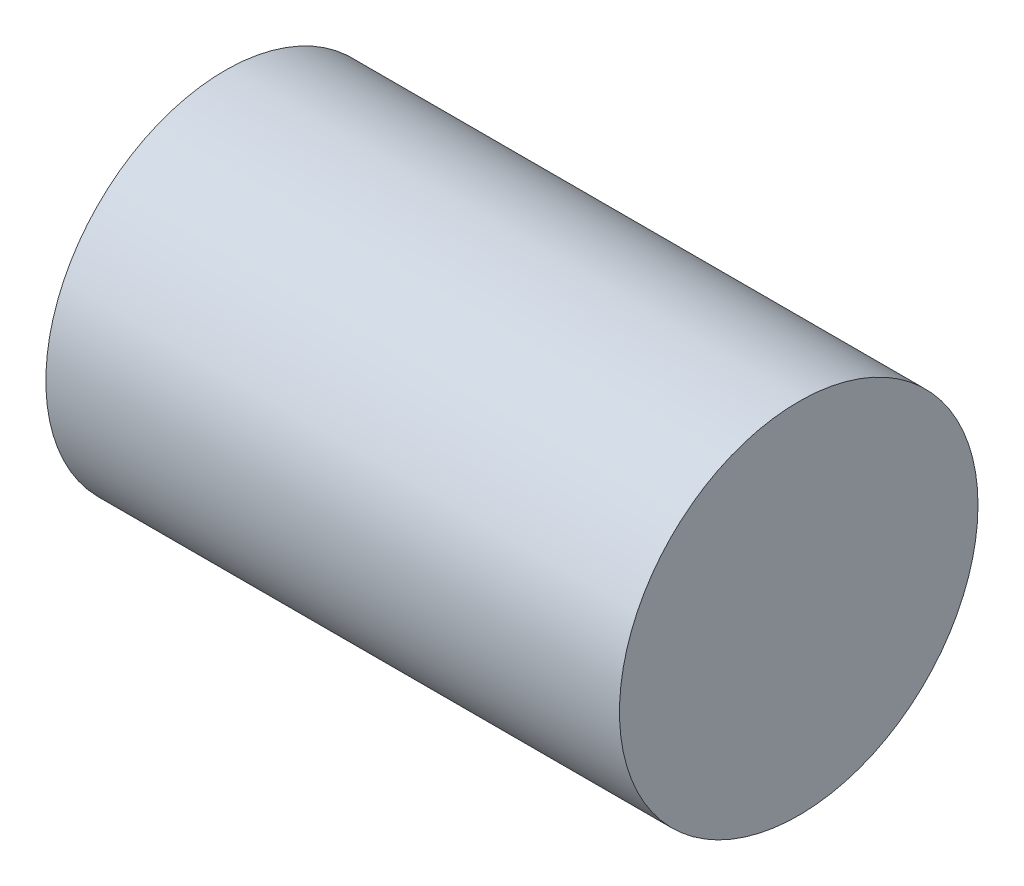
from build123d import *

# Parameters (mm, degrees)
ESQUISSE1_R      = 2.5
EXTRUSION1_DEPTH = 8


with BuildPart() as part:
    # Esquisse1 → Extrusion1 (new body)
    with BuildSketch(Plane(origin=(0, 0, 0), x_dir=(0, 0, -1), z_dir=(1, 0, 0))):
        Circle(ESQUISSE1_R)
    extrude(amount=EXTRUSION1_DEPTH)


solid = part.part
